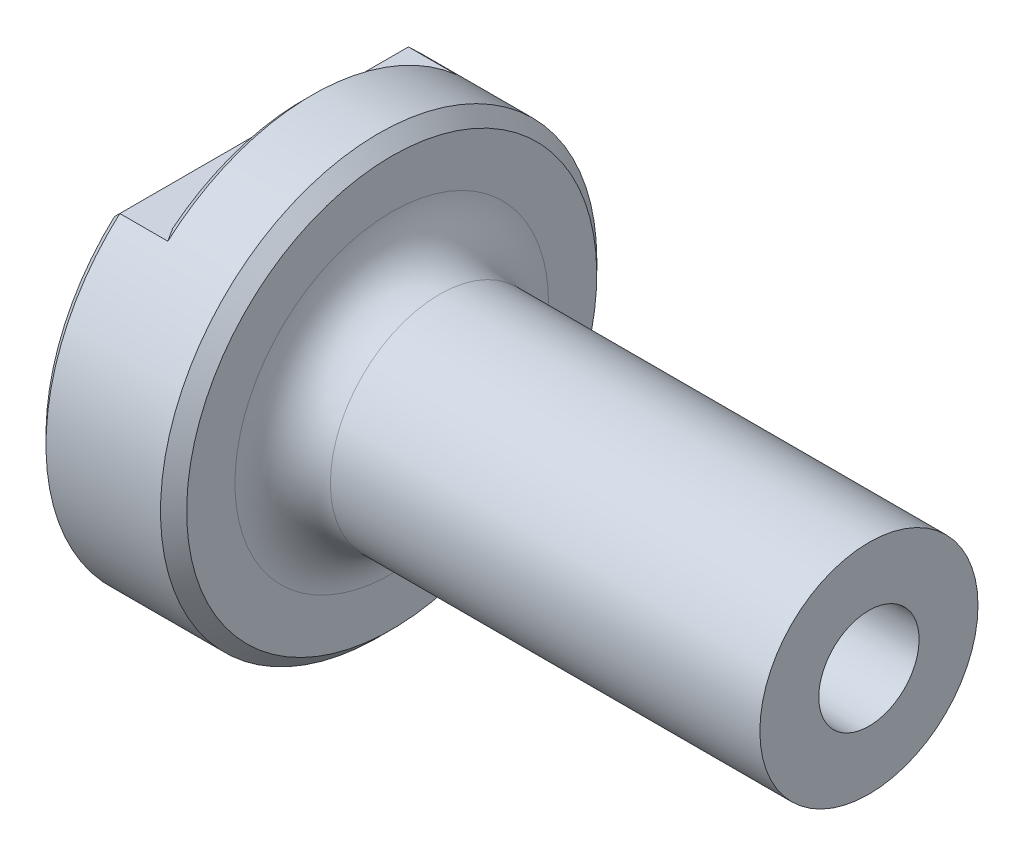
ISO-10303-21;
HEADER;
FILE_DESCRIPTION(('STEP AP214'),'2;1');
FILE_NAME('part.step','',(''),(''),'','','');
FILE_SCHEMA(('AUTOMOTIVE_DESIGN { 1 0 10303 214 1 1 1 1 }'));
ENDSEC;
DATA;
#1=APPLICATION_CONTEXT('core data for automotive mechanical design processes');
#2=APPLICATION_PROTOCOL_DEFINITION('international standard','automotive_design',2000,#1);
#3=PRODUCT_CONTEXT('',#1,'mechanical');
#4=PRODUCT('Part','Part','',(#3));
#5=PRODUCT_RELATED_PRODUCT_CATEGORY('part','',(#4));
#6=PRODUCT_DEFINITION_FORMATION('','',#4);
#7=PRODUCT_DEFINITION_CONTEXT('part definition',#1,'design');
#8=PRODUCT_DEFINITION('design','',#6,#7);
#9=PRODUCT_DEFINITION_SHAPE('','',#8);
#10=(LENGTH_UNIT() NAMED_UNIT(*) SI_UNIT(.MILLI.,.METRE.));
#11=(NAMED_UNIT(*) PLANE_ANGLE_UNIT() SI_UNIT($,.RADIAN.));
#12=(NAMED_UNIT(*) SI_UNIT($,.STERADIAN.) SOLID_ANGLE_UNIT());
#13=UNCERTAINTY_MEASURE_WITH_UNIT(LENGTH_MEASURE(1.E-05),#10,'distance_accuracy_value','');
#14=(GEOMETRIC_REPRESENTATION_CONTEXT(3) GLOBAL_UNCERTAINTY_ASSIGNED_CONTEXT((#13)) GLOBAL_UNIT_ASSIGNED_CONTEXT((#10,
#11,#12)) REPRESENTATION_CONTEXT('',''));
#15=CARTESIAN_POINT('',(0.,0.,0.));
#16=DIRECTION('',(0.,0.,1.));
#17=DIRECTION('',(1.,0.,0.));
#18=AXIS2_PLACEMENT_3D('',#15,#16,#17);
#19=CARTESIAN_POINT('',(35.71875,0.,0.));
#20=DIRECTION('',(1.,0.,0.));
#21=DIRECTION('',(0.,0.,-1.));
#22=AXIS2_PLACEMENT_3D('',#19,#20,#21);
#23=PLANE('',#22);
#24=CARTESIAN_POINT('',(35.71875,0.,0.));
#25=DIRECTION('',(1.,0.,0.));
#26=DIRECTION('',(0.,1.,0.));
#27=AXIS2_PLACEMENT_3D('',#24,#25,#26);
#28=CIRCLE('',#27,12.7);
#29=CARTESIAN_POINT('',(35.71875,12.7,0.));
#30=VERTEX_POINT('',#29);
#31=EDGE_CURVE('E102',#30,#30,#28,.T.);
#32=ORIENTED_EDGE('',*,*,#31,.T.);
#33=EDGE_LOOP('',(#32));
#34=FACE_BOUND('',#33,.T.);
#35=CARTESIAN_POINT('',(35.71875,0.,0.));
#36=DIRECTION('',(1.,0.,0.));
#37=DIRECTION('',(0.,1.,0.));
#38=AXIS2_PLACEMENT_3D('',#35,#36,#37);
#39=CIRCLE('',#38,5.8404139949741);
#40=CARTESIAN_POINT('',(35.71875,5.8404139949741,0.));
#41=VERTEX_POINT('',#40);
#42=EDGE_CURVE('E158',#41,#41,#39,.T.);
#43=ORIENTED_EDGE('',*,*,#42,.F.);
#44=EDGE_LOOP('',(#43));
#45=FACE_BOUND('',#44,.T.);
#46=ADVANCED_FACE('F33',(#34,#45),#23,.T.);
#47=CARTESIAN_POINT('',(-35.71875,0.,0.));
#48=DIRECTION('',(1.,0.,0.));
#49=DIRECTION('',(0.,0.,-1.));
#50=AXIS2_PLACEMENT_3D('',#47,#48,#49);
#51=PLANE('',#50);
#52=CARTESIAN_POINT('',(-35.71875,0.,0.));
#53=DIRECTION('',(1.,0.,0.));
#54=DIRECTION('',(0.,0.,-1.));
#55=AXIS2_PLACEMENT_3D('',#52,#53,#54);
#56=CIRCLE('',#55,24.384);
#57=CARTESIAN_POINT('',(-35.71875,18.034,-16.4120169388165));
#58=VERTEX_POINT('',#57);
#59=CARTESIAN_POINT('',(-35.71875,18.034,16.4120169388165));
#60=VERTEX_POINT('',#59);
#61=EDGE_CURVE('E53',#58,#60,#56,.F.);
#62=ORIENTED_EDGE('',*,*,#61,.T.);
#63=DIRECTION('',(0.,0.,-1.));
#64=VECTOR('',#63,1.);
#65=CARTESIAN_POINT('',(-35.71875,18.034,0.));
#66=LINE('',#65,#64);
#67=EDGE_CURVE('E127',#60,#58,#66,.T.);
#68=ORIENTED_EDGE('',*,*,#67,.T.);
#69=EDGE_LOOP('',(#62,#68));
#70=FACE_BOUND('',#69,.T.);
#71=CARTESIAN_POINT('',(-35.71875,0.,0.));
#72=DIRECTION('',(1.,0.,0.));
#73=DIRECTION('',(0.,1.,0.));
#74=AXIS2_PLACEMENT_3D('',#71,#72,#73);
#75=CIRCLE('',#74,9.80045101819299);
#76=CARTESIAN_POINT('',(-35.71875,9.80045101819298,0.));
#77=VERTEX_POINT('',#76);
#78=EDGE_CURVE('E107',#77,#77,#75,.T.);
#79=ORIENTED_EDGE('',*,*,#78,.T.);
#80=EDGE_LOOP('',(#79));
#81=FACE_BOUND('',#80,.T.);
#82=ADVANCED_FACE('F167',(#70,#81),#51,.F.);
#83=CARTESIAN_POINT('',(35.71875,0.,0.));
#84=DIRECTION('',(-1.,0.,0.));
#85=DIRECTION('',(0.,0.,1.));
#86=AXIS2_PLACEMENT_3D('',#83,#84,#85);
#87=CYLINDRICAL_SURFACE('',#86,25.4);
#88=CARTESIAN_POINT('',(-21.3677500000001,0.,0.));
#89=DIRECTION('',(1.,0.,0.));
#90=DIRECTION('',(0.,0.,-1.));
#91=AXIS2_PLACEMENT_3D('',#88,#89,#90);
#92=CIRCLE('',#91,25.4);
#93=CARTESIAN_POINT('',(-21.3677500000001,0.,-25.4));
#94=VERTEX_POINT('',#93);
#95=EDGE_CURVE('E98',#94,#94,#92,.F.);
#96=ORIENTED_EDGE('',*,*,#95,.T.);
#97=EDGE_LOOP('',(#96));
#98=FACE_BOUND('',#97,.T.);
#99=DIRECTION('',(-1.,0.,0.));
#100=VECTOR('',#99,1.);
#101=CARTESIAN_POINT('',(35.71875,19.05,-16.8005208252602));
#102=LINE('',#101,#100);
#103=CARTESIAN_POINT('',(-34.70275,19.05,-16.8005208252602));
#104=VERTEX_POINT('',#103);
#105=CARTESIAN_POINT('',(-29.11475,19.05,-16.8005208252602));
#106=VERTEX_POINT('',#105);
#107=EDGE_CURVE('E101',#104,#106,#102,.F.);
#108=ORIENTED_EDGE('',*,*,#107,.T.);
#109=CARTESIAN_POINT('',(-29.11475,0.,0.));
#110=DIRECTION('',(-1.,0.,0.));
#111=DIRECTION('',(0.,0.,1.));
#112=AXIS2_PLACEMENT_3D('',#109,#110,#111);
#113=CIRCLE('',#112,25.4);
#114=CARTESIAN_POINT('',(-29.11475,19.05,16.8005208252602));
#115=VERTEX_POINT('',#114);
#116=EDGE_CURVE('E87',#106,#115,#113,.F.);
#117=ORIENTED_EDGE('',*,*,#116,.T.);
#118=DIRECTION('',(-1.,0.,0.));
#119=VECTOR('',#118,1.);
#120=CARTESIAN_POINT('',(35.71875,19.05,16.8005208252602));
#121=LINE('',#120,#119);
#122=CARTESIAN_POINT('',(-34.70275,19.05,16.8005208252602));
#123=VERTEX_POINT('',#122);
#124=EDGE_CURVE('E104',#115,#123,#121,.T.);
#125=ORIENTED_EDGE('',*,*,#124,.T.);
#126=CARTESIAN_POINT('',(-34.70275,0.,0.));
#127=DIRECTION('',(1.,0.,0.));
#128=DIRECTION('',(0.,0.,-1.));
#129=AXIS2_PLACEMENT_3D('',#126,#127,#128);
#130=CIRCLE('',#129,25.4);
#131=EDGE_CURVE('E97',#123,#104,#130,.T.);
#132=ORIENTED_EDGE('',*,*,#131,.T.);
#133=EDGE_LOOP('',(#108,#117,#125,#132));
#134=FACE_BOUND('',#133,.T.);
#135=ADVANCED_FACE('F189',(#98,#134),#87,.T.);
#136=CARTESIAN_POINT('',(-30.13075,0.,0.));
#137=DIRECTION('',(-1.,0.,0.));
#138=DIRECTION('',(0.,0.,1.));
#139=AXIS2_PLACEMENT_3D('',#136,#137,#138);
#140=PLANE('',#139);
#141=DIRECTION('',(0.,0.,1.));
#142=VECTOR('',#141,1.);
#143=CARTESIAN_POINT('',(-30.13075,19.05,-25.4));
#144=LINE('',#143,#142);
#145=CARTESIAN_POINT('',(-30.13075,19.05,-15.2209380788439));
#146=VERTEX_POINT('',#145);
#147=CARTESIAN_POINT('',(-30.13075,19.05,15.2209380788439));
#148=VERTEX_POINT('',#147);
#149=EDGE_CURVE('E96',#146,#148,#144,.T.);
#150=ORIENTED_EDGE('',*,*,#149,.T.);
#151=CARTESIAN_POINT('',(-30.13075,0.,0.));
#152=DIRECTION('',(-1.,0.,0.));
#153=DIRECTION('',(0.,0.,1.));
#154=AXIS2_PLACEMENT_3D('',#151,#152,#153);
#155=CIRCLE('',#154,24.384);
#156=EDGE_CURVE('E85',#148,#146,#155,.T.);
#157=ORIENTED_EDGE('',*,*,#156,.T.);
#158=EDGE_LOOP('',(#150,#157));
#159=FACE_BOUND('',#158,.T.);
#160=ADVANCED_FACE('F95',(#159),#140,.T.);
#161=CARTESIAN_POINT('',(-30.13075,19.05,-25.4));
#162=DIRECTION('',(0.,-1.,0.));
#163=DIRECTION('',(0.,0.,-1.));
#164=AXIS2_PLACEMENT_3D('',#161,#162,#163);
#165=PLANE('',#164);
#166=ORIENTED_EDGE('',*,*,#107,.F.);
#167=DIRECTION('',(0.,0.,1.));
#168=VECTOR('',#167,1.);
#169=CARTESIAN_POINT('',(-34.70275,19.05,-25.4));
#170=LINE('',#169,#168);
#171=EDGE_CURVE('E91',#104,#123,#170,.T.);
#172=ORIENTED_EDGE('',*,*,#171,.T.);
#173=ORIENTED_EDGE('',*,*,#124,.F.);
#174=CARTESIAN_POINT('',(-29.11475,19.05,16.8005208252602));
#175=CARTESIAN_POINT('',(-29.2010969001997,19.05,16.6699759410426));
#176=CARTESIAN_POINT('',(-29.287050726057,19.05,16.5391707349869));
#177=CARTESIAN_POINT('',(-29.4581291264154,19.05,16.2770272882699));
#178=CARTESIAN_POINT('',(-29.5432537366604,19.05,16.1456890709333));
#179=CARTESIAN_POINT('',(-29.7126383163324,19.05,15.8824555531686));
#180=CARTESIAN_POINT('',(-29.7968982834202,19.05,15.7505602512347));
#181=CARTESIAN_POINT('',(-29.9645140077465,19.05,15.4861884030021));
#182=CARTESIAN_POINT('',(-30.0478697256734,19.05,15.3537118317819));
#183=CARTESIAN_POINT('',(-30.13075,19.05,15.2209380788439));
#184=B_SPLINE_CURVE_WITH_KNOTS('',3,(#174,#175,#176,#177,#178,#179,#180,#181,#182,#183),
.UNSPECIFIED.,.F.,.F.,(4,2,2,2,4),(0.,0.4695524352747,0.939084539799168,1.40861791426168,
1.878171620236),.UNSPECIFIED.);
#185=EDGE_CURVE('E11',#115,#148,#184,.T.);
#186=ORIENTED_EDGE('',*,*,#185,.T.);
#187=ORIENTED_EDGE('',*,*,#149,.F.);
#188=CARTESIAN_POINT('',(-30.13075,19.05,-15.2209380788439));
#189=CARTESIAN_POINT('',(-30.0478697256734,19.05,-15.3537118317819));
#190=CARTESIAN_POINT('',(-29.9645140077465,19.05,-15.4861884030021));
#191=CARTESIAN_POINT('',(-29.7968982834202,19.05,-15.7505602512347));
#192=CARTESIAN_POINT('',(-29.7126383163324,19.05,-15.8824555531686));
#193=CARTESIAN_POINT('',(-29.5432537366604,19.05,-16.1456890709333));
#194=CARTESIAN_POINT('',(-29.4581291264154,19.05,-16.2770272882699));
#195=CARTESIAN_POINT('',(-29.287050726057,19.05,-16.5391707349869));
#196=CARTESIAN_POINT('',(-29.2010969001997,19.05,-16.6699759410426));
#197=CARTESIAN_POINT('',(-29.11475,19.05,-16.8005208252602));
#198=B_SPLINE_CURVE_WITH_KNOTS('',3,(#188,#189,#190,#191,#192,#193,#194,#195,#196,#197),
.UNSPECIFIED.,.F.,.F.,(4,2,2,2,4),(0.,0.469553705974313,0.939087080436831,1.40861918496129,
1.878171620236),.UNSPECIFIED.);
#199=EDGE_CURVE('E46',#146,#106,#198,.T.);
#200=ORIENTED_EDGE('',*,*,#199,.T.);
#201=EDGE_LOOP('',(#166,#172,#173,#186,#187,#200));
#202=FACE_BOUND('',#201,.T.);
#203=ADVANCED_FACE('F100',(#202),#165,.F.);
#204=CARTESIAN_POINT('',(-19.84375,-25.4,0.));
#205=DIRECTION('',(1.,0.,0.));
#206=DIRECTION('',(0.,1.,0.));
#207=AXIS2_PLACEMENT_3D('',#204,#205,#206);
#208=PLANE('',#207);
#209=CARTESIAN_POINT('',(-19.84375,0.,0.));
#210=DIRECTION('',(1.,0.,0.));
#211=DIRECTION('',(0.,1.,0.));
#212=AXIS2_PLACEMENT_3D('',#209,#210,#211);
#213=CIRCLE('',#212,23.876);
#214=CARTESIAN_POINT('',(-19.84375,23.876,0.));
#215=VERTEX_POINT('',#214);
#216=EDGE_CURVE('E119',#215,#215,#213,.T.);
#217=ORIENTED_EDGE('',*,*,#216,.T.);
#218=EDGE_LOOP('',(#217));
#219=FACE_BOUND('',#218,.T.);
#220=CARTESIAN_POINT('',(-19.84375,0.,0.));
#221=DIRECTION('',(1.,0.,0.));
#222=DIRECTION('',(0.,1.,0.));
#223=AXIS2_PLACEMENT_3D('',#220,#221,#222);
#224=CIRCLE('',#223,18.25625);
#225=CARTESIAN_POINT('',(-19.84375,18.25625,0.));
#226=VERTEX_POINT('',#225);
#227=EDGE_CURVE('E116',#226,#226,#224,.F.);
#228=ORIENTED_EDGE('',*,*,#227,.T.);
#229=EDGE_LOOP('',(#228));
#230=FACE_BOUND('',#229,.T.);
#231=ADVANCED_FACE('F181',(#219,#230),#208,.T.);
#232=CARTESIAN_POINT('',(35.71875,0.,0.));
#233=DIRECTION('',(1.,0.,0.));
#234=DIRECTION('',(0.,1.,0.));
#235=AXIS2_PLACEMENT_3D('',#232,#233,#234);
#236=CYLINDRICAL_SURFACE('',#235,12.7);
#237=CARTESIAN_POINT('',(-14.2875,0.,0.));
#238=DIRECTION('',(1.,0.,0.));
#239=DIRECTION('',(0.,1.,0.));
#240=AXIS2_PLACEMENT_3D('',#237,#238,#239);
#241=CIRCLE('',#240,12.7);
#242=CARTESIAN_POINT('',(-14.2875,12.7,0.));
#243=VERTEX_POINT('',#242);
#244=EDGE_CURVE('E113',#243,#243,#241,.T.);
#245=ORIENTED_EDGE('',*,*,#244,.T.);
#246=EDGE_LOOP('',(#245));
#247=FACE_BOUND('',#246,.T.);
#248=ORIENTED_EDGE('',*,*,#31,.F.);
#249=EDGE_LOOP('',(#248));
#250=FACE_BOUND('',#249,.T.);
#251=ADVANCED_FACE('F172',(#247,#250),#236,.T.);
#252=CARTESIAN_POINT('',(-43.79595,0.,0.));
#253=DIRECTION('',(1.,0.,0.));
#254=DIRECTION('',(0.,1.,0.));
#255=AXIS2_PLACEMENT_3D('',#252,#253,#254);
#256=SPHERICAL_SURFACE('',#255,12.7);
#257=CARTESIAN_POINT('',(-31.8698727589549,0.,0.));
#258=DIRECTION('',(1.,0.,0.));
#259=DIRECTION('',(0.,1.,0.));
#260=AXIS2_PLACEMENT_3D('',#257,#258,#259);
#261=CIRCLE('',#260,4.365625);
#262=CARTESIAN_POINT('',(-31.8698727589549,4.36562500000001,0.));
#263=VERTEX_POINT('',#262);
#264=EDGE_CURVE('E155',#263,#263,#261,.T.);
#265=CARTESIAN_POINT('',(-31.8698727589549,4.36562500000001,0.));
#266=CARTESIAN_POINT('',(-31.8940012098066,4.43153961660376,0.));
#267=CARTESIAN_POINT('',(-31.9186762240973,4.49725415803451,0.));
#268=CARTESIAN_POINT('',(-31.9691123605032,4.62826511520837,0.));
#269=CARTESIAN_POINT('',(-31.9948734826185,4.69356153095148,0.));
#270=CARTESIAN_POINT('',(-32.04747481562,4.82371826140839,0.));
#271=CARTESIAN_POINT('',(-32.0743150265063,4.88857857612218,0.));
#272=CARTESIAN_POINT('',(-32.1290671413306,5.01784527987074,0.));
#273=CARTESIAN_POINT('',(-32.1569790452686,5.08225166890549,0.));
#274=CARTESIAN_POINT('',(-32.213866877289,5.2105928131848,0.));
#275=CARTESIAN_POINT('',(-32.2428428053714,5.27452756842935,0.));
#276=CARTESIAN_POINT('',(-32.3018507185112,5.40190786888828,0.));
#277=CARTESIAN_POINT('',(-32.3318827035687,5.46535341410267,0.));
#278=CARTESIAN_POINT('',(-32.3929944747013,5.5917378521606,0.));
#279=CARTESIAN_POINT('',(-32.4240742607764,5.65467674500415,0.));
#280=CARTESIAN_POINT('',(-32.487273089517,5.78003057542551,0.));
#281=CARTESIAN_POINT('',(-32.5193921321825,5.84244551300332,0.));
#282=CARTESIAN_POINT('',(-32.5846606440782,5.9667342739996,0.));
#283=CARTESIAN_POINT('',(-32.6178101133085,6.02860809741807,0.));
#284=CARTESIAN_POINT('',(-32.6851303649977,6.15179761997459,0.));
#285=CARTESIAN_POINT('',(-32.7193011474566,6.21311331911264,0.));
#286=CARTESIAN_POINT('',(-32.7886546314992,6.33516973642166,0.));
#287=CARTESIAN_POINT('',(-32.8238373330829,6.39591045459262,0.));
#288=CARTESIAN_POINT('',(-32.895204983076,6.51680021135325,0.));
#289=CARTESIAN_POINT('',(-32.9313899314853,6.57694924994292,0.));
#290=CARTESIAN_POINT('',(-33.0047521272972,6.69663911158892,0.));
#291=CARTESIAN_POINT('',(-33.0419293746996,6.75617993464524,0.));
#292=CARTESIAN_POINT('',(-33.1172659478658,6.87463699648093,0.));
#293=CARTESIAN_POINT('',(-33.1554252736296,6.93355323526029,0.));
#294=CARTESIAN_POINT('',(-33.2327155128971,7.05074493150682,0.));
#295=CARTESIAN_POINT('',(-33.2718464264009,7.10902038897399,0.));
#296=CARTESIAN_POINT('',(-33.3510690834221,7.22491450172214,0.));
#297=CARTESIAN_POINT('',(-33.3911608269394,7.28253315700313,0.));
#298=CARTESIAN_POINT('',(-33.4722941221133,7.39709782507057,0.));
#299=CARTESIAN_POINT('',(-33.5133356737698,7.45404383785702,0.));
#300=CARTESIAN_POINT('',(-33.5963573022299,7.56724756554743,0.));
#301=CARTESIAN_POINT('',(-33.6383373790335,7.6235052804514,0.));
#302=CARTESIAN_POINT('',(-33.7232245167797,7.73531694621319,0.));
#303=CARTESIAN_POINT('',(-33.7661315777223,7.79087089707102,0.));
#304=CARTESIAN_POINT('',(-33.8528608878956,7.90125976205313,0.));
#305=CARTESIAN_POINT('',(-33.8966831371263,7.95609467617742,0.));
#306=CARTESIAN_POINT('',(-33.9852307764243,8.06503039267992,0.));
#307=CARTESIAN_POINT('',(-34.0299561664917,8.11913119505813,0.));
#308=CARTESIAN_POINT('',(-34.1202977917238,8.2265838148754,0.));
#309=CARTESIAN_POINT('',(-34.1659140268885,8.27993563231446,0.));
#310=CARTESIAN_POINT('',(-34.2580248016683,8.38587561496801,0.));
#311=CARTESIAN_POINT('',(-34.3045193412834,8.43846378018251,0.));
#312=CARTESIAN_POINT('',(-34.3983739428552,8.54286200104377,0.));
#313=CARTESIAN_POINT('',(-34.445734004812,8.59467205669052,0.));
#314=CARTESIAN_POINT('',(-34.5413066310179,8.69749981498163,0.));
#315=CARTESIAN_POINT('',(-34.589519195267,8.74851751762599,0.));
#316=CARTESIAN_POINT('',(-34.686783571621,8.84974654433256,0.));
#317=CARTESIAN_POINT('',(-34.7358353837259,8.89995786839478,0.));
#318=CARTESIAN_POINT('',(-34.8347647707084,8.99956033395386,0.));
#319=CARTESIAN_POINT('',(-34.8846423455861,9.04895147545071,0.));
#320=CARTESIAN_POINT('',(-34.9852095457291,9.14689999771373,0.));
#321=CARTESIAN_POINT('',(-35.0358991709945,9.19545737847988,0.));
#322=CARTESIAN_POINT('',(-35.1380765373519,9.29172502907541,0.));
#323=CARTESIAN_POINT('',(-35.1895642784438,9.33943529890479,0.));
#324=CARTESIAN_POINT('',(-35.2933237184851,9.43399561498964,0.));
#325=CARTESIAN_POINT('',(-35.3455954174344,9.48084566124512,0.));
#326=CARTESIAN_POINT('',(-35.4509084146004,9.57367263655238,0.));
#327=CARTESIAN_POINT('',(-35.503949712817,9.61964956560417,0.));
#328=CARTESIAN_POINT('',(-35.6107872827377,9.7107177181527,0.));
#329=CARTESIAN_POINT('',(-35.6645835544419,9.75580894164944,0.));
#330=CARTESIAN_POINT('',(-35.71875,9.80045101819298,0.));
#331=B_SPLINE_CURVE_WITH_KNOTS('',3,(#265,#266,#267,#268,#269,#270,#271,#272,#273,#274,#275,
#276,#277,#278,#279,#280,#281,#282,#283,#284,#285,#286,#287,#288,#289,#290,#291,#292,#293,#294,
#295,#296,#297,#298,#299,#300,#301,#302,#303,#304,#305,#306,#307,#308,#309,#310,#311,#312,#313,
#314,#315,#316,#317,#318,#319,#320,#321,#322,#323,#324,#325,#326,#327,#328,#329,#330),
.UNSPECIFIED.,.F.,.F.,(4,2,2,2,2,2,2,2,2,2,2,2,2,2,2,2,2,2,2,2,2,2,2,2,2,2,2,2,2,2,2,2,4),(0.,
0.210573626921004,0.421147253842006,0.631720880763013,0.842294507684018,1.05286813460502,
1.26344176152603,1.47401538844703,1.68458901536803,1.89516264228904,2.10573626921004,
2.31630989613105,2.52688352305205,2.73745714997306,2.94803077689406,3.15860440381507,
3.36917803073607,3.57975165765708,3.79032528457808,4.00089891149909,4.21147253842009,
4.4220461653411,4.6326197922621,4.84319341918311,5.05376704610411,5.26434067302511,
5.47491429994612,5.68548792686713,5.89606155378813,6.10663518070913,6.31720880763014,
6.52778243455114,6.73835606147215),.UNSPECIFIED.);
#332=EDGE_CURVE('BSEAM169',#263,#77,#331,.T.);
#333=ORIENTED_EDGE('',*,*,#264,.T.);
#334=ORIENTED_EDGE('',*,*,#78,.F.);
#335=ORIENTED_EDGE('',*,*,#332,.T.);
#336=ORIENTED_EDGE('',*,*,#332,.F.);
#337=EDGE_LOOP('',(#333,#335,#334,#336));
#338=FACE_BOUND('',#337,.T.);
#339=ADVANCED_FACE('F169',(#338),#256,.F.);
#340=CARTESIAN_POINT('',(-31.8698727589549,0.,0.));
#341=DIRECTION('',(1.,0.,0.));
#342=DIRECTION('',(0.,1.,0.));
#343=AXIS2_PLACEMENT_3D('',#340,#341,#342);
#344=CONICAL_SURFACE('',#343,4.365625,0.0218166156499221);
#345=ORIENTED_EDGE('',*,*,#42,.T.);
#346=EDGE_LOOP('',(#345));
#347=FACE_BOUND('',#346,.T.);
#348=ORIENTED_EDGE('',*,*,#264,.F.);
#349=EDGE_LOOP('',(#348));
#350=FACE_BOUND('',#349,.T.);
#351=ADVANCED_FACE('F171',(#347,#350),#344,.F.);
#352=CARTESIAN_POINT('',(-14.2875,0.,0.));
#353=DIRECTION('',(1.,0.,0.));
#354=DIRECTION('',(0.,1.,0.));
#355=AXIS2_PLACEMENT_3D('',#352,#353,#354);
#356=TOROIDAL_SURFACE('',#355,18.25625,5.55625);
#357=ORIENTED_EDGE('',*,*,#227,.F.);
#358=EDGE_LOOP('',(#357));
#359=FACE_BOUND('',#358,.T.);
#360=ORIENTED_EDGE('',*,*,#244,.F.);
#361=EDGE_LOOP('',(#360));
#362=FACE_BOUND('',#361,.T.);
#363=ADVANCED_FACE('F178',(#359,#362),#356,.F.);
#364=CARTESIAN_POINT('',(-19.84375,0.,0.));
#365=DIRECTION('',(-1.,0.,0.));
#366=DIRECTION('',(0.,0.,1.));
#367=AXIS2_PLACEMENT_3D('',#364,#365,#366);
#368=CONICAL_SURFACE('',#367,23.876,0.785398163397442);
#369=ORIENTED_EDGE('',*,*,#95,.F.);
#370=EDGE_LOOP('',(#369));
#371=FACE_BOUND('',#370,.T.);
#372=ORIENTED_EDGE('',*,*,#216,.F.);
#373=EDGE_LOOP('',(#372));
#374=FACE_BOUND('',#373,.T.);
#375=ADVANCED_FACE('F145',(#371,#374),#368,.T.);
#376=CARTESIAN_POINT('',(-30.13075,0.,0.));
#377=DIRECTION('',(1.,0.,0.));
#378=DIRECTION('',(0.,0.,-1.));
#379=AXIS2_PLACEMENT_3D('',#376,#377,#378);
#380=CONICAL_SURFACE('',#379,24.384,0.785398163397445);
#381=ORIENTED_EDGE('',*,*,#185,.F.);
#382=ORIENTED_EDGE('',*,*,#116,.F.);
#383=ORIENTED_EDGE('',*,*,#199,.F.);
#384=ORIENTED_EDGE('',*,*,#156,.F.);
#385=EDGE_LOOP('',(#381,#382,#383,#384));
#386=FACE_BOUND('',#385,.T.);
#387=ADVANCED_FACE('F84',(#386),#380,.T.);
#388=CARTESIAN_POINT('',(-34.70275,0.,0.));
#389=DIRECTION('',(1.,0.,0.));
#390=DIRECTION('',(0.,0.,-1.));
#391=AXIS2_PLACEMENT_3D('',#388,#389,#390);
#392=CONICAL_SURFACE('',#391,25.4,0.785398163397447);
#393=CARTESIAN_POINT('',(-35.71875,18.034,-16.4120169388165));
#394=CARTESIAN_POINT('',(-35.549551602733,18.203198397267,-16.4774733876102));
#395=CARTESIAN_POINT('',(-35.3802857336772,18.3724642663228,-16.5425769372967));
#396=CARTESIAN_POINT('',(-35.0416190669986,18.7111309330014,-16.6720782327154));
#397=CARTESIAN_POINT('',(-34.8722182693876,18.8805317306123,-16.7364759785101));
#398=CARTESIAN_POINT('',(-34.70275,19.05,-16.8005208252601));
#399=B_SPLINE_CURVE_WITH_KNOTS('',3,(#393,#394,#395,#396,#397,#398),.UNSPECIFIED.,.F.,.F.,(4,2,
4),(0.,0.744219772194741,1.48843947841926),.UNSPECIFIED.);
#400=EDGE_CURVE('E61',#104,#58,#399,.F.);
#401=ORIENTED_EDGE('',*,*,#400,.F.);
#402=ORIENTED_EDGE('',*,*,#131,.F.);
#403=CARTESIAN_POINT('',(-34.70275,19.05,16.8005208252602));
#404=CARTESIAN_POINT('',(-34.8722182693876,18.8805317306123,16.7364759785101));
#405=CARTESIAN_POINT('',(-35.0416190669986,18.7111309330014,16.6720782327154));
#406=CARTESIAN_POINT('',(-35.3802857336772,18.3724642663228,16.5425769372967));
#407=CARTESIAN_POINT('',(-35.549551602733,18.203198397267,16.4774733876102));
#408=CARTESIAN_POINT('',(-35.71875,18.034,16.4120169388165));
#409=B_SPLINE_CURVE_WITH_KNOTS('',3,(#403,#404,#405,#406,#407,#408),.UNSPECIFIED.,.F.,.F.,(4,2,
4),(0.,0.744219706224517,1.48843947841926),.UNSPECIFIED.);
#410=EDGE_CURVE('E38',#60,#123,#409,.F.);
#411=ORIENTED_EDGE('',*,*,#410,.F.);
#412=ORIENTED_EDGE('',*,*,#61,.F.);
#413=EDGE_LOOP('',(#401,#402,#411,#412));
#414=FACE_BOUND('',#413,.T.);
#415=ADVANCED_FACE('F144',(#414),#392,.T.);
#416=CARTESIAN_POINT('',(-35.71875,18.034,0.));
#417=DIRECTION('',(0.707106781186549,-0.707106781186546,0.));
#418=DIRECTION('',(0.,0.,-1.));
#419=AXIS2_PLACEMENT_3D('',#416,#417,#418);
#420=PLANE('',#419);
#421=ORIENTED_EDGE('',*,*,#410,.T.);
#422=ORIENTED_EDGE('',*,*,#171,.F.);
#423=ORIENTED_EDGE('',*,*,#400,.T.);
#424=ORIENTED_EDGE('',*,*,#67,.F.);
#425=EDGE_LOOP('',(#421,#422,#423,#424));
#426=FACE_BOUND('',#425,.T.);
#427=ADVANCED_FACE('F35',(#426),#420,.F.);
#428=CLOSED_SHELL('',(#46,#82,#135,#160,#203,#231,#251,#339,#351,#363,#375,#387,#415,#427));
#429=MANIFOLD_SOLID_BREP('B2',#428);
#430=ADVANCED_BREP_SHAPE_REPRESENTATION('',(#18,#429),#14);
#431=SHAPE_DEFINITION_REPRESENTATION(#9,#430);
ENDSEC;
END-ISO-10303-21;
